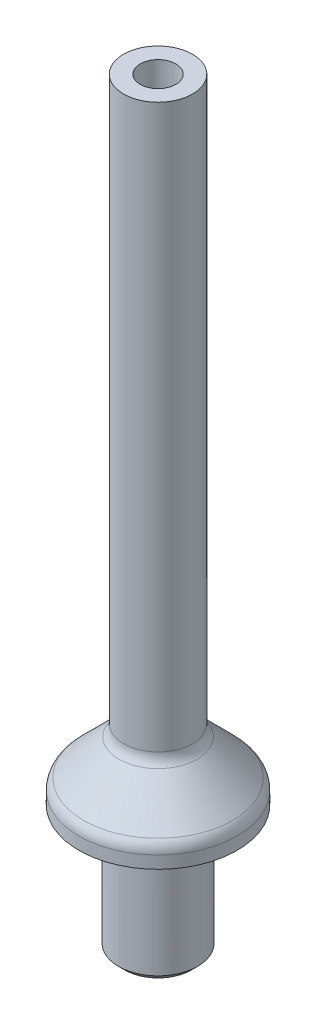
ISO-10303-21;
HEADER;
FILE_DESCRIPTION(('STEP AP214'),'2;1');
FILE_NAME('part.step','',(''),(''),'','','');
FILE_SCHEMA(('AUTOMOTIVE_DESIGN { 1 0 10303 214 1 1 1 1 }'));
ENDSEC;
DATA;
#1=APPLICATION_CONTEXT('core data for automotive mechanical design processes');
#2=APPLICATION_PROTOCOL_DEFINITION('international standard','automotive_design',2000,#1);
#3=PRODUCT_CONTEXT('',#1,'mechanical');
#4=PRODUCT('Part','Part','',(#3));
#5=PRODUCT_RELATED_PRODUCT_CATEGORY('part','',(#4));
#6=PRODUCT_DEFINITION_FORMATION('','',#4);
#7=PRODUCT_DEFINITION_CONTEXT('part definition',#1,'design');
#8=PRODUCT_DEFINITION('design','',#6,#7);
#9=PRODUCT_DEFINITION_SHAPE('','',#8);
#10=(LENGTH_UNIT() NAMED_UNIT(*) SI_UNIT(.MILLI.,.METRE.));
#11=(NAMED_UNIT(*) PLANE_ANGLE_UNIT() SI_UNIT($,.RADIAN.));
#12=(NAMED_UNIT(*) SI_UNIT($,.STERADIAN.) SOLID_ANGLE_UNIT());
#13=UNCERTAINTY_MEASURE_WITH_UNIT(LENGTH_MEASURE(1.E-05),#10,'distance_accuracy_value','');
#14=(GEOMETRIC_REPRESENTATION_CONTEXT(3) GLOBAL_UNCERTAINTY_ASSIGNED_CONTEXT((#13)) GLOBAL_UNIT_ASSIGNED_CONTEXT((#10,
#11,#12)) REPRESENTATION_CONTEXT('',''));
#15=CARTESIAN_POINT('',(0.,0.,0.));
#16=DIRECTION('',(0.,0.,1.));
#17=DIRECTION('',(1.,0.,0.));
#18=AXIS2_PLACEMENT_3D('',#15,#16,#17);
#19=CARTESIAN_POINT('',(-6.9215,0.,0.));
#20=DIRECTION('',(0.,1.,0.));
#21=DIRECTION('',(0.,0.,1.));
#22=AXIS2_PLACEMENT_3D('',#19,#20,#21);
#23=PLANE('',#22);
#24=CARTESIAN_POINT('',(0.,0.,0.));
#25=DIRECTION('',(0.,1.,0.));
#26=DIRECTION('',(0.,0.,1.));
#27=AXIS2_PLACEMENT_3D('',#24,#25,#26);
#28=CIRCLE('',#27,8.3947);
#29=CARTESIAN_POINT('',(0.,0.,8.3947));
#30=VERTEX_POINT('',#29);
#31=EDGE_CURVE('E69',#30,#30,#28,.F.);
#32=ORIENTED_EDGE('',*,*,#31,.T.);
#33=EDGE_LOOP('',(#32));
#34=FACE_BOUND('',#33,.T.);
#35=CARTESIAN_POINT('',(0.,0.,0.));
#36=DIRECTION('',(0.,-1.,0.));
#37=DIRECTION('',(0.,0.,-1.));
#38=AXIS2_PLACEMENT_3D('',#35,#36,#37);
#39=CIRCLE('',#38,6.9215);
#40=CARTESIAN_POINT('',(0.,0.,-6.9215));
#41=VERTEX_POINT('',#40);
#42=EDGE_CURVE('E81',#41,#41,#39,.T.);
#43=ORIENTED_EDGE('',*,*,#42,.F.);
#44=EDGE_LOOP('',(#43));
#45=FACE_BOUND('',#44,.T.);
#46=ADVANCED_FACE('F37',(#34,#45),#23,.F.);
#47=CARTESIAN_POINT('',(-7.9375,-25.4,0.));
#48=DIRECTION('',(0.,1.,0.));
#49=DIRECTION('',(0.,0.,1.));
#50=AXIS2_PLACEMENT_3D('',#47,#48,#49);
#51=PLANE('',#50);
#52=CARTESIAN_POINT('',(0.,-25.4,0.));
#53=DIRECTION('',(0.,1.,0.));
#54=DIRECTION('',(0.,0.,1.));
#55=AXIS2_PLACEMENT_3D('',#52,#53,#54);
#56=CIRCLE('',#55,6.66749999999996);
#57=CARTESIAN_POINT('',(0.,-25.4,6.66749999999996));
#58=VERTEX_POINT('',#57);
#59=EDGE_CURVE('E44',#58,#58,#56,.F.);
#60=ORIENTED_EDGE('',*,*,#59,.T.);
#61=EDGE_LOOP('',(#60));
#62=FACE_BOUND('',#61,.T.);
#63=CARTESIAN_POINT('',(0.,-25.4,0.));
#64=DIRECTION('',(0.,-1.,0.));
#65=DIRECTION('',(0.,0.,-1.));
#66=AXIS2_PLACEMENT_3D('',#63,#64,#65);
#67=CIRCLE('',#66,4.8895);
#68=CARTESIAN_POINT('',(0.,-25.4,-4.8895));
#69=VERTEX_POINT('',#68);
#70=EDGE_CURVE('E99',#69,#69,#67,.T.);
#71=ORIENTED_EDGE('',*,*,#70,.F.);
#72=EDGE_LOOP('',(#71));
#73=FACE_BOUND('',#72,.T.);
#74=ADVANCED_FACE('F136',(#62,#73),#51,.F.);
#75=CARTESIAN_POINT('',(0.,0.,0.));
#76=DIRECTION('',(0.,-1.,0.));
#77=DIRECTION('',(0.,0.,-1.));
#78=AXIS2_PLACEMENT_3D('',#75,#76,#77);
#79=CYLINDRICAL_SURFACE('',#78,7.9375);
#80=CARTESIAN_POINT('',(0.,-24.13,0.));
#81=DIRECTION('',(0.,1.,0.));
#82=DIRECTION('',(0.,0.,1.));
#83=AXIS2_PLACEMENT_3D('',#80,#81,#82);
#84=CIRCLE('',#83,7.9375);
#85=CARTESIAN_POINT('',(0.,-24.13,7.9375));
#86=VERTEX_POINT('',#85);
#87=EDGE_CURVE('E10',#86,#86,#84,.T.);
#88=ORIENTED_EDGE('',*,*,#87,.T.);
#89=EDGE_LOOP('',(#88));
#90=FACE_BOUND('',#89,.T.);
#91=CARTESIAN_POINT('',(0.,-1.905,0.));
#92=DIRECTION('',(0.,-1.,0.));
#93=DIRECTION('',(0.,0.,-1.));
#94=AXIS2_PLACEMENT_3D('',#91,#92,#93);
#95=CIRCLE('',#94,7.9375);
#96=CARTESIAN_POINT('',(0.,-1.905,-7.9375));
#97=VERTEX_POINT('',#96);
#98=EDGE_CURVE('E75',#97,#97,#95,.T.);
#99=ORIENTED_EDGE('',*,*,#98,.T.);
#100=EDGE_LOOP('',(#99));
#101=FACE_BOUND('',#100,.T.);
#102=ADVANCED_FACE('F143',(#90,#101),#79,.T.);
#103=CARTESIAN_POINT('',(-7.9375,-1.905,0.));
#104=DIRECTION('',(0.,-1.,0.));
#105=DIRECTION('',(0.,0.,-1.));
#106=AXIS2_PLACEMENT_3D('',#103,#104,#105);
#107=PLANE('',#106);
#108=ORIENTED_EDGE('',*,*,#98,.F.);
#109=EDGE_LOOP('',(#108));
#110=FACE_BOUND('',#109,.T.);
#111=CARTESIAN_POINT('',(0.,-1.905,0.));
#112=DIRECTION('',(0.,-1.,0.));
#113=DIRECTION('',(0.,0.,-1.));
#114=AXIS2_PLACEMENT_3D('',#111,#112,#113);
#115=CIRCLE('',#114,6.9215);
#116=CARTESIAN_POINT('',(0.,-1.905,-6.9215));
#117=VERTEX_POINT('',#116);
#118=EDGE_CURVE('E78',#117,#117,#115,.T.);
#119=ORIENTED_EDGE('',*,*,#118,.T.);
#120=EDGE_LOOP('',(#119));
#121=FACE_BOUND('',#120,.T.);
#122=ADVANCED_FACE('F158',(#110,#121),#107,.F.);
#123=CARTESIAN_POINT('',(0.,0.,0.));
#124=DIRECTION('',(0.,-1.,0.));
#125=DIRECTION('',(0.,0.,-1.));
#126=AXIS2_PLACEMENT_3D('',#123,#124,#125);
#127=CYLINDRICAL_SURFACE('',#126,6.9215);
#128=ORIENTED_EDGE('',*,*,#118,.F.);
#129=EDGE_LOOP('',(#128));
#130=FACE_BOUND('',#129,.T.);
#131=ORIENTED_EDGE('',*,*,#42,.T.);
#132=EDGE_LOOP('',(#131));
#133=FACE_BOUND('',#132,.T.);
#134=ADVANCED_FACE('F150',(#130,#133),#127,.T.);
#135=CARTESIAN_POINT('',(0.,0.,0.));
#136=DIRECTION('',(0.,1.,0.));
#137=DIRECTION('',(0.,0.,1.));
#138=AXIS2_PLACEMENT_3D('',#135,#136,#137);
#139=CIRCLE('',#138,13.2715);
#140=CARTESIAN_POINT('',(0.,0.,13.2715));
#141=VERTEX_POINT('',#140);
#142=EDGE_CURVE('E66',#141,#141,#139,.T.);
#143=ORIENTED_EDGE('',*,*,#142,.T.);
#144=EDGE_LOOP('',(#143));
#145=FACE_BOUND('',#144,.T.);
#146=CARTESIAN_POINT('',(0.,0.,0.));
#147=DIRECTION('',(0.,-1.,0.));
#148=DIRECTION('',(0.,0.,-1.));
#149=AXIS2_PLACEMENT_3D('',#146,#147,#148);
#150=CIRCLE('',#149,15.875);
#151=CARTESIAN_POINT('',(0.,0.,-15.875));
#152=VERTEX_POINT('',#151);
#153=EDGE_CURVE('E84',#152,#152,#150,.T.);
#154=ORIENTED_EDGE('',*,*,#153,.T.);
#155=EDGE_LOOP('',(#154));
#156=FACE_BOUND('',#155,.T.);
#157=ADVANCED_FACE('F139',(#145,#156),#23,.F.);
#158=CARTESIAN_POINT('',(0.,0.,0.));
#159=DIRECTION('',(0.,-1.,0.));
#160=DIRECTION('',(0.,0.,-1.));
#161=AXIS2_PLACEMENT_3D('',#158,#159,#160);
#162=CYLINDRICAL_SURFACE('',#161,15.875);
#163=CARTESIAN_POINT('',(0.,2.49487193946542,0.));
#164=DIRECTION('',(0.,1.,0.));
#165=DIRECTION('',(0.,0.,1.));
#166=AXIS2_PLACEMENT_3D('',#163,#164,#165);
#167=CIRCLE('',#166,15.875);
#168=CARTESIAN_POINT('',(0.,2.49487193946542,15.875));
#169=VERTEX_POINT('',#168);
#170=EDGE_CURVE('E48',#169,#169,#167,.F.);
#171=ORIENTED_EDGE('',*,*,#170,.T.);
#172=EDGE_LOOP('',(#171));
#173=FACE_BOUND('',#172,.T.);
#174=ORIENTED_EDGE('',*,*,#153,.F.);
#175=EDGE_LOOP('',(#174));
#176=FACE_BOUND('',#175,.T.);
#177=ADVANCED_FACE('F149',(#173,#176),#162,.T.);
#178=CARTESIAN_POINT('',(0.,12.7635,0.));
#179=DIRECTION('',(0.,-1.,0.));
#180=DIRECTION('',(0.,0.,-1.));
#181=AXIS2_PLACEMENT_3D('',#178,#179,#180);
#182=CONICAL_SURFACE('',#181,6.92149999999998,0.78539816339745);
#183=CARTESIAN_POINT('',(0.,11.8335640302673,0.));
#184=DIRECTION('',(0.,-1.,0.));
#185=DIRECTION('',(0.,0.,-1.));
#186=AXIS2_PLACEMENT_3D('',#183,#184,#185);
#187=CIRCLE('',#186,7.8514359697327);
#188=CARTESIAN_POINT('',(0.,11.8335640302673,-7.8514359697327));
#189=VERTEX_POINT('',#188);
#190=EDGE_CURVE('E57',#189,#189,#187,.T.);
#191=ORIENTED_EDGE('',*,*,#190,.T.);
#192=EDGE_LOOP('',(#191));
#193=FACE_BOUND('',#192,.T.);
#194=CARTESIAN_POINT('',(0.,4.73993596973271,0.));
#195=DIRECTION('',(0.,1.,0.));
#196=DIRECTION('',(0.,0.,1.));
#197=AXIS2_PLACEMENT_3D('',#194,#195,#196);
#198=CIRCLE('',#197,14.9450640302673);
#199=CARTESIAN_POINT('',(0.,4.73993596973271,14.9450640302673));
#200=VERTEX_POINT('',#199);
#201=EDGE_CURVE('E60',#200,#200,#198,.T.);
#202=ORIENTED_EDGE('',*,*,#201,.T.);
#203=EDGE_LOOP('',(#202));
#204=FACE_BOUND('',#203,.T.);
#205=ADVANCED_FACE('F156',(#193,#204),#182,.T.);
#206=CARTESIAN_POINT('',(0.,0.,0.));
#207=DIRECTION('',(0.,-1.,0.));
#208=DIRECTION('',(0.,0.,-1.));
#209=AXIS2_PLACEMENT_3D('',#206,#207,#208);
#210=CYLINDRICAL_SURFACE('',#209,6.92149999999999);
#211=CARTESIAN_POINT('',(0.,14.0786280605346,0.));
#212=DIRECTION('',(0.,-1.,0.));
#213=DIRECTION('',(0.,0.,-1.));
#214=AXIS2_PLACEMENT_3D('',#211,#212,#213);
#215=CIRCLE('',#214,6.92149999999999);
#216=CARTESIAN_POINT('',(0.,14.0786280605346,-6.92149999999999));
#217=VERTEX_POINT('',#216);
#218=EDGE_CURVE('E52',#217,#217,#215,.F.);
#219=ORIENTED_EDGE('',*,*,#218,.T.);
#220=EDGE_LOOP('',(#219));
#221=FACE_BOUND('',#220,.T.);
#222=CARTESIAN_POINT('',(0.,127.,0.));
#223=DIRECTION('',(0.,-1.,0.));
#224=DIRECTION('',(0.,0.,-1.));
#225=AXIS2_PLACEMENT_3D('',#222,#223,#224);
#226=CIRCLE('',#225,6.9215);
#227=CARTESIAN_POINT('',(0.,127.,-6.9215));
#228=VERTEX_POINT('',#227);
#229=EDGE_CURVE('E87',#228,#228,#226,.T.);
#230=ORIENTED_EDGE('',*,*,#229,.T.);
#231=EDGE_LOOP('',(#230));
#232=FACE_BOUND('',#231,.T.);
#233=ADVANCED_FACE('F192',(#221,#232),#210,.T.);
#234=CARTESIAN_POINT('',(-6.9215,127.,0.));
#235=DIRECTION('',(0.,-1.,0.));
#236=DIRECTION('',(0.,0.,-1.));
#237=AXIS2_PLACEMENT_3D('',#234,#235,#236);
#238=PLANE('',#237);
#239=ORIENTED_EDGE('',*,*,#229,.F.);
#240=EDGE_LOOP('',(#239));
#241=FACE_BOUND('',#240,.T.);
#242=CARTESIAN_POINT('',(0.,127.,0.));
#243=DIRECTION('',(0.,-1.,0.));
#244=DIRECTION('',(0.,0.,-1.));
#245=AXIS2_PLACEMENT_3D('',#242,#243,#244);
#246=CIRCLE('',#245,3.571875);
#247=CARTESIAN_POINT('',(0.,127.,-3.571875));
#248=VERTEX_POINT('',#247);
#249=EDGE_CURVE('E90',#248,#248,#246,.T.);
#250=ORIENTED_EDGE('',*,*,#249,.T.);
#251=EDGE_LOOP('',(#250));
#252=FACE_BOUND('',#251,.T.);
#253=ADVANCED_FACE('F198',(#241,#252),#238,.F.);
#254=CARTESIAN_POINT('',(0.,0.,0.));
#255=DIRECTION('',(0.,-1.,0.));
#256=DIRECTION('',(0.,0.,-1.));
#257=AXIS2_PLACEMENT_3D('',#254,#255,#256);
#258=CYLINDRICAL_SURFACE('',#257,3.57187499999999);
#259=ORIENTED_EDGE('',*,*,#249,.F.);
#260=EDGE_LOOP('',(#259));
#261=FACE_BOUND('',#260,.T.);
#262=CARTESIAN_POINT('',(0.,-7.62,0.));
#263=DIRECTION('',(0.,-1.,0.));
#264=DIRECTION('',(0.,0.,-1.));
#265=AXIS2_PLACEMENT_3D('',#262,#263,#264);
#266=CIRCLE('',#265,3.57187499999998);
#267=CARTESIAN_POINT('',(0.,-7.62,-3.57187499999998));
#268=VERTEX_POINT('',#267);
#269=EDGE_CURVE('E93',#268,#268,#266,.T.);
#270=ORIENTED_EDGE('',*,*,#269,.T.);
#271=EDGE_LOOP('',(#270));
#272=FACE_BOUND('',#271,.T.);
#273=ADVANCED_FACE('F204',(#261,#272),#258,.F.);
#274=CARTESIAN_POINT('',(-3.57187499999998,-7.62,0.));
#275=DIRECTION('',(0.,1.,0.));
#276=DIRECTION('',(0.,0.,1.));
#277=AXIS2_PLACEMENT_3D('',#274,#275,#276);
#278=PLANE('',#277);
#279=ORIENTED_EDGE('',*,*,#269,.F.);
#280=EDGE_LOOP('',(#279));
#281=FACE_BOUND('',#280,.T.);
#282=CARTESIAN_POINT('',(0.,-7.62,0.));
#283=DIRECTION('',(0.,-1.,0.));
#284=DIRECTION('',(0.,0.,-1.));
#285=AXIS2_PLACEMENT_3D('',#282,#283,#284);
#286=CIRCLE('',#285,4.8895);
#287=CARTESIAN_POINT('',(0.,-7.62,-4.8895));
#288=VERTEX_POINT('',#287);
#289=EDGE_CURVE('E96',#288,#288,#286,.T.);
#290=ORIENTED_EDGE('',*,*,#289,.T.);
#291=EDGE_LOOP('',(#290));
#292=FACE_BOUND('',#291,.T.);
#293=ADVANCED_FACE('F208',(#281,#292),#278,.F.);
#294=CARTESIAN_POINT('',(0.,0.,0.));
#295=DIRECTION('',(0.,-1.,0.));
#296=DIRECTION('',(0.,0.,-1.));
#297=AXIS2_PLACEMENT_3D('',#294,#295,#296);
#298=CYLINDRICAL_SURFACE('',#297,4.8895);
#299=ORIENTED_EDGE('',*,*,#289,.F.);
#300=EDGE_LOOP('',(#299));
#301=FACE_BOUND('',#300,.T.);
#302=ORIENTED_EDGE('',*,*,#70,.T.);
#303=EDGE_LOOP('',(#302));
#304=FACE_BOUND('',#303,.T.);
#305=ADVANCED_FACE('F121',(#301,#304),#298,.F.);
#306=CARTESIAN_POINT('',(0.,2.1971,0.));
#307=DIRECTION('',(0.,1.,0.));
#308=DIRECTION('',(-1.,0.,0.));
#309=AXIS2_PLACEMENT_3D('',#306,#307,#308);
#310=TOROIDAL_SURFACE('',#309,8.9662,0.444499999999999);
#311=CARTESIAN_POINT('',(0.,2.6416,0.));
#312=DIRECTION('',(0.,1.,0.));
#313=DIRECTION('',(-1.,0.,0.));
#314=AXIS2_PLACEMENT_3D('',#311,#312,#313);
#315=CIRCLE('',#314,8.9662);
#316=CARTESIAN_POINT('',(-8.9662,2.6416,0.));
#317=VERTEX_POINT('',#316);
#318=EDGE_CURVE('E111',#317,#317,#315,.T.);
#319=ORIENTED_EDGE('',*,*,#318,.F.);
#320=EDGE_LOOP('',(#319));
#321=FACE_BOUND('',#320,.T.);
#322=CARTESIAN_POINT('',(0.,2.1971,0.));
#323=DIRECTION('',(0.,1.,0.));
#324=DIRECTION('',(-1.,0.,0.));
#325=AXIS2_PLACEMENT_3D('',#322,#323,#324);
#326=CIRCLE('',#325,8.5217);
#327=CARTESIAN_POINT('',(-8.5217,2.1971,0.));
#328=VERTEX_POINT('',#327);
#329=EDGE_CURVE('E102',#328,#328,#326,.T.);
#330=ORIENTED_EDGE('',*,*,#329,.T.);
#331=EDGE_LOOP('',(#330));
#332=FACE_BOUND('',#331,.T.);
#333=ADVANCED_FACE('F117',(#321,#332),#310,.F.);
#334=CARTESIAN_POINT('',(0.,0.,0.));
#335=DIRECTION('',(0.,1.,0.));
#336=DIRECTION('',(-1.,0.,0.));
#337=AXIS2_PLACEMENT_3D('',#334,#335,#336);
#338=CYLINDRICAL_SURFACE('',#337,8.5217);
#339=CARTESIAN_POINT('',(0.,0.127,0.));
#340=DIRECTION('',(0.,1.,0.));
#341=DIRECTION('',(0.,0.,1.));
#342=AXIS2_PLACEMENT_3D('',#339,#340,#341);
#343=CIRCLE('',#342,8.5217);
#344=CARTESIAN_POINT('',(0.,0.127,8.5217));
#345=VERTEX_POINT('',#344);
#346=EDGE_CURVE('E72',#345,#345,#343,.T.);
#347=ORIENTED_EDGE('',*,*,#346,.T.);
#348=EDGE_LOOP('',(#347));
#349=FACE_BOUND('',#348,.T.);
#350=ORIENTED_EDGE('',*,*,#329,.F.);
#351=EDGE_LOOP('',(#350));
#352=FACE_BOUND('',#351,.T.);
#353=ADVANCED_FACE('F120',(#349,#352),#338,.T.);
#354=CARTESIAN_POINT('',(0.,0.,0.));
#355=DIRECTION('',(0.,1.,0.));
#356=DIRECTION('',(-1.,0.,0.));
#357=AXIS2_PLACEMENT_3D('',#354,#355,#356);
#358=CYLINDRICAL_SURFACE('',#357,13.1445);
#359=CARTESIAN_POINT('',(0.,0.127,0.));
#360=DIRECTION('',(0.,1.,0.));
#361=DIRECTION('',(0.,0.,1.));
#362=AXIS2_PLACEMENT_3D('',#359,#360,#361);
#363=CIRCLE('',#362,13.1445);
#364=CARTESIAN_POINT('',(0.,0.127,13.1445));
#365=VERTEX_POINT('',#364);
#366=EDGE_CURVE('E63',#365,#365,#363,.F.);
#367=ORIENTED_EDGE('',*,*,#366,.T.);
#368=EDGE_LOOP('',(#367));
#369=FACE_BOUND('',#368,.T.);
#370=CARTESIAN_POINT('',(0.,2.1971,0.));
#371=DIRECTION('',(0.,1.,0.));
#372=DIRECTION('',(-1.,0.,0.));
#373=AXIS2_PLACEMENT_3D('',#370,#371,#372);
#374=CIRCLE('',#373,13.1445);
#375=CARTESIAN_POINT('',(-13.1445,2.1971,0.));
#376=VERTEX_POINT('',#375);
#377=EDGE_CURVE('E105',#376,#376,#374,.T.);
#378=ORIENTED_EDGE('',*,*,#377,.T.);
#379=EDGE_LOOP('',(#378));
#380=FACE_BOUND('',#379,.T.);
#381=ADVANCED_FACE('F126',(#369,#380),#358,.F.);
#382=CARTESIAN_POINT('',(0.,2.1971,0.));
#383=DIRECTION('',(0.,1.,0.));
#384=DIRECTION('',(-1.,0.,0.));
#385=AXIS2_PLACEMENT_3D('',#382,#383,#384);
#386=TOROIDAL_SURFACE('',#385,12.7,0.444499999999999);
#387=ORIENTED_EDGE('',*,*,#377,.F.);
#388=EDGE_LOOP('',(#387));
#389=FACE_BOUND('',#388,.T.);
#390=CARTESIAN_POINT('',(0.,2.6416,0.));
#391=DIRECTION('',(0.,1.,0.));
#392=DIRECTION('',(-1.,0.,0.));
#393=AXIS2_PLACEMENT_3D('',#390,#391,#392);
#394=CIRCLE('',#393,12.7);
#395=CARTESIAN_POINT('',(-12.7,2.6416,0.));
#396=VERTEX_POINT('',#395);
#397=EDGE_CURVE('E108',#396,#396,#394,.T.);
#398=ORIENTED_EDGE('',*,*,#397,.T.);
#399=EDGE_LOOP('',(#398));
#400=FACE_BOUND('',#399,.T.);
#401=ADVANCED_FACE('F132',(#389,#400),#386,.F.);
#402=CARTESIAN_POINT('',(-12.7,2.6416,0.));
#403=DIRECTION('',(0.,1.,0.));
#404=DIRECTION('',(-1.,0.,0.));
#405=AXIS2_PLACEMENT_3D('',#402,#403,#404);
#406=PLANE('',#405);
#407=ORIENTED_EDGE('',*,*,#397,.F.);
#408=EDGE_LOOP('',(#407));
#409=FACE_BOUND('',#408,.T.);
#410=ORIENTED_EDGE('',*,*,#318,.T.);
#411=EDGE_LOOP('',(#410));
#412=FACE_BOUND('',#411,.T.);
#413=ADVANCED_FACE('F115',(#409,#412),#406,.F.);
#414=CARTESIAN_POINT('',(0.,0.127,0.));
#415=DIRECTION('',(0.,1.,0.));
#416=DIRECTION('',(0.,0.,1.));
#417=AXIS2_PLACEMENT_3D('',#414,#415,#416);
#418=TOROIDAL_SURFACE('',#417,8.3947,0.127);
#419=ORIENTED_EDGE('',*,*,#31,.F.);
#420=EDGE_LOOP('',(#419));
#421=FACE_BOUND('',#420,.T.);
#422=ORIENTED_EDGE('',*,*,#346,.F.);
#423=EDGE_LOOP('',(#422));
#424=FACE_BOUND('',#423,.T.);
#425=ADVANCED_FACE('F168',(#421,#424),#418,.T.);
#426=CARTESIAN_POINT('',(0.,0.127,0.));
#427=DIRECTION('',(0.,1.,0.));
#428=DIRECTION('',(0.,0.,1.));
#429=AXIS2_PLACEMENT_3D('',#426,#427,#428);
#430=TOROIDAL_SURFACE('',#429,13.2715,0.127);
#431=ORIENTED_EDGE('',*,*,#366,.F.);
#432=EDGE_LOOP('',(#431));
#433=FACE_BOUND('',#432,.T.);
#434=ORIENTED_EDGE('',*,*,#142,.F.);
#435=EDGE_LOOP('',(#434));
#436=FACE_BOUND('',#435,.T.);
#437=ADVANCED_FACE('F165',(#433,#436),#430,.T.);
#438=CARTESIAN_POINT('',(0.,14.0786280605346,0.));
#439=DIRECTION('',(0.,-1.,0.));
#440=DIRECTION('',(0.,0.,-1.));
#441=AXIS2_PLACEMENT_3D('',#438,#439,#440);
#442=TOROIDAL_SURFACE('',#441,10.0965,3.175);
#443=ORIENTED_EDGE('',*,*,#218,.F.);
#444=EDGE_LOOP('',(#443));
#445=FACE_BOUND('',#444,.T.);
#446=ORIENTED_EDGE('',*,*,#190,.F.);
#447=EDGE_LOOP('',(#446));
#448=FACE_BOUND('',#447,.T.);
#449=ADVANCED_FACE('F167',(#445,#448),#442,.F.);
#450=CARTESIAN_POINT('',(0.,2.49487193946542,0.));
#451=DIRECTION('',(0.,1.,0.));
#452=DIRECTION('',(0.,0.,1.));
#453=AXIS2_PLACEMENT_3D('',#450,#451,#452);
#454=TOROIDAL_SURFACE('',#453,12.7,3.175);
#455=ORIENTED_EDGE('',*,*,#201,.F.);
#456=EDGE_LOOP('',(#455));
#457=FACE_BOUND('',#456,.T.);
#458=ORIENTED_EDGE('',*,*,#170,.F.);
#459=EDGE_LOOP('',(#458));
#460=FACE_BOUND('',#459,.T.);
#461=ADVANCED_FACE('F175',(#457,#460),#454,.T.);
#462=CARTESIAN_POINT('',(0.,-25.4,0.));
#463=DIRECTION('',(0.,1.,0.));
#464=DIRECTION('',(0.,0.,1.));
#465=AXIS2_PLACEMENT_3D('',#462,#463,#464);
#466=CONICAL_SURFACE('',#465,6.66749999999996,0.785398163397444);
#467=ORIENTED_EDGE('',*,*,#87,.F.);
#468=EDGE_LOOP('',(#467));
#469=FACE_BOUND('',#468,.T.);
#470=ORIENTED_EDGE('',*,*,#59,.F.);
#471=EDGE_LOOP('',(#470));
#472=FACE_BOUND('',#471,.T.);
#473=ADVANCED_FACE('F39',(#469,#472),#466,.T.);
#474=CLOSED_SHELL('',(#46,#74,#102,#122,#134,#157,#177,#205,#233,#253,#273,#293,#305,#333,#353,
#381,#401,#413,#425,#437,#449,#461,#473));
#475=MANIFOLD_SOLID_BREP('B2',#474);
#476=ADVANCED_BREP_SHAPE_REPRESENTATION('',(#18,#475),#14);
#477=SHAPE_DEFINITION_REPRESENTATION(#9,#476);
ENDSEC;
END-ISO-10303-21;
